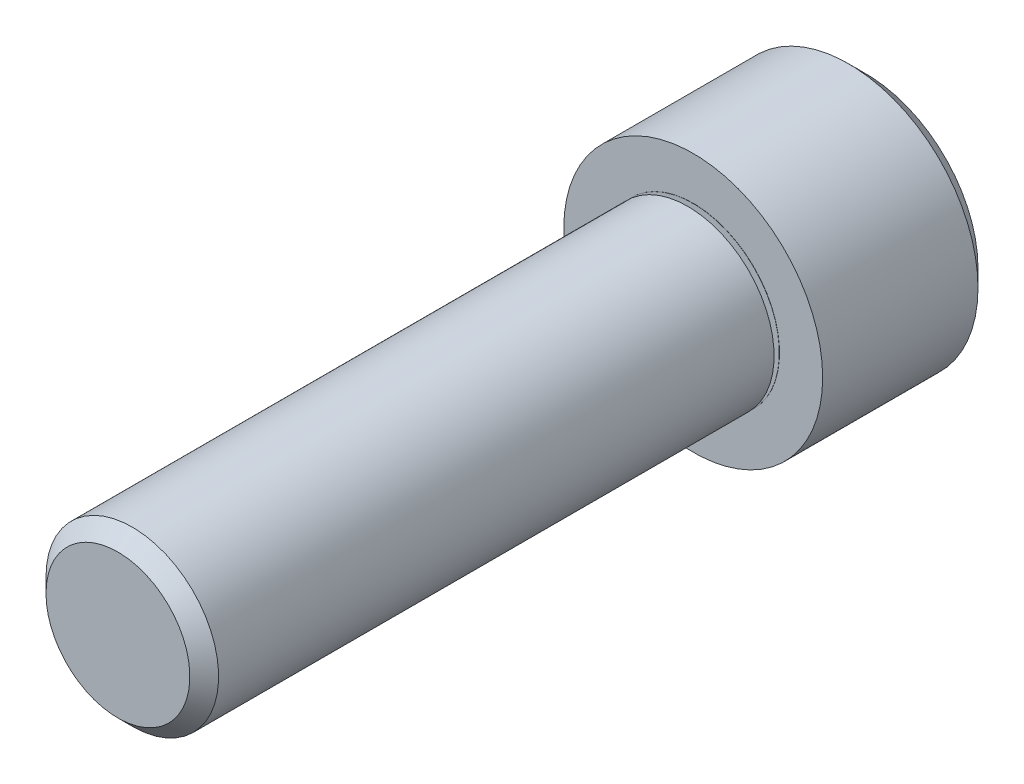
ISO-10303-21;
HEADER;
FILE_DESCRIPTION(('STEP AP214'),'2;1');
FILE_NAME('part.step','',(''),(''),'','','');
FILE_SCHEMA(('AUTOMOTIVE_DESIGN { 1 0 10303 214 1 1 1 1 }'));
ENDSEC;
DATA;
#1=APPLICATION_CONTEXT('core data for automotive mechanical design processes');
#2=APPLICATION_PROTOCOL_DEFINITION('international standard','automotive_design',2000,#1);
#3=PRODUCT_CONTEXT('',#1,'mechanical');
#4=PRODUCT('Part','Part','',(#3));
#5=PRODUCT_RELATED_PRODUCT_CATEGORY('part','',(#4));
#6=PRODUCT_DEFINITION_FORMATION('','',#4);
#7=PRODUCT_DEFINITION_CONTEXT('part definition',#1,'design');
#8=PRODUCT_DEFINITION('design','',#6,#7);
#9=PRODUCT_DEFINITION_SHAPE('','',#8);
#10=(LENGTH_UNIT() NAMED_UNIT(*) SI_UNIT(.MILLI.,.METRE.));
#11=(NAMED_UNIT(*) PLANE_ANGLE_UNIT() SI_UNIT($,.RADIAN.));
#12=(NAMED_UNIT(*) SI_UNIT($,.STERADIAN.) SOLID_ANGLE_UNIT());
#13=UNCERTAINTY_MEASURE_WITH_UNIT(LENGTH_MEASURE(1.E-05),#10,'distance_accuracy_value','');
#14=(GEOMETRIC_REPRESENTATION_CONTEXT(3) GLOBAL_UNCERTAINTY_ASSIGNED_CONTEXT((#13)) GLOBAL_UNIT_ASSIGNED_CONTEXT((#10,
#11,#12)) REPRESENTATION_CONTEXT('',''));
#15=CARTESIAN_POINT('',(0.,0.,0.));
#16=DIRECTION('',(0.,0.,1.));
#17=DIRECTION('',(1.,0.,0.));
#18=AXIS2_PLACEMENT_3D('',#15,#16,#17);
#19=CARTESIAN_POINT('',(0.,0.,-9.525));
#20=DIRECTION('',(0.,0.,1.));
#21=DIRECTION('',(1.,0.,0.));
#22=AXIS2_PLACEMENT_3D('',#19,#20,#21);
#23=PLANE('',#22);
#24=DIRECTION('',(-0.5,-0.866025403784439,0.));
#25=VECTOR('',#24,1.);
#26=CARTESIAN_POINT('',(4.57538541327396,0.,-9.525));
#27=LINE('',#26,#25);
#28=CARTESIAN_POINT('',(4.57538541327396,0.,-9.525));
#29=VERTEX_POINT('',#28);
#30=CARTESIAN_POINT('',(2.28769270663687,-3.96240000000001,-9.525));
#31=VERTEX_POINT('',#30);
#32=EDGE_CURVE('E145',#29,#31,#27,.T.);
#33=ORIENTED_EDGE('',*,*,#32,.F.);
#34=DIRECTION('',(0.499999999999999,-0.866025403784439,0.));
#35=VECTOR('',#34,1.);
#36=CARTESIAN_POINT('',(2.28769270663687,3.96240000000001,-9.525));
#37=LINE('',#36,#35);
#38=CARTESIAN_POINT('',(2.28769270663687,3.96240000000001,-9.525));
#39=VERTEX_POINT('',#38);
#40=EDGE_CURVE('E64',#39,#29,#37,.T.);
#41=ORIENTED_EDGE('',*,*,#40,.F.);
#42=DIRECTION('',(1.,0.,0.));
#43=VECTOR('',#42,1.);
#44=CARTESIAN_POINT('',(-2.28769270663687,3.96240000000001,-9.525));
#45=LINE('',#44,#43);
#46=CARTESIAN_POINT('',(-2.28769270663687,3.96240000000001,-9.525));
#47=VERTEX_POINT('',#46);
#48=EDGE_CURVE('E158',#47,#39,#45,.T.);
#49=ORIENTED_EDGE('',*,*,#48,.F.);
#50=DIRECTION('',(0.5,0.866025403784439,0.));
#51=VECTOR('',#50,1.);
#52=CARTESIAN_POINT('',(-4.57538541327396,0.,-9.525));
#53=LINE('',#52,#51);
#54=CARTESIAN_POINT('',(-4.57538541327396,0.,-9.525));
#55=VERTEX_POINT('',#54);
#56=EDGE_CURVE('E155',#55,#47,#53,.T.);
#57=ORIENTED_EDGE('',*,*,#56,.F.);
#58=DIRECTION('',(-0.5,0.866025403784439,0.));
#59=VECTOR('',#58,1.);
#60=CARTESIAN_POINT('',(-2.28769270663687,-3.96240000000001,-9.525));
#61=LINE('',#60,#59);
#62=CARTESIAN_POINT('',(-2.28769270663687,-3.96240000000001,-9.525));
#63=VERTEX_POINT('',#62);
#64=EDGE_CURVE('E112',#63,#55,#61,.T.);
#65=ORIENTED_EDGE('',*,*,#64,.F.);
#66=DIRECTION('',(-1.,0.,0.));
#67=VECTOR('',#66,1.);
#68=CARTESIAN_POINT('',(2.28769270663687,-3.96240000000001,-9.525));
#69=LINE('',#68,#67);
#70=EDGE_CURVE('E149',#31,#63,#69,.T.);
#71=ORIENTED_EDGE('',*,*,#70,.F.);
#72=EDGE_LOOP('',(#33,#41,#49,#57,#65,#71));
#73=FACE_BOUND('',#72,.T.);
#74=CARTESIAN_POINT('',(0.,0.,-9.525));
#75=DIRECTION('',(0.,0.,-1.));
#76=DIRECTION('',(-1.,0.,0.));
#77=AXIS2_PLACEMENT_3D('',#74,#75,#76);
#78=CIRCLE('',#77,6.19125000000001);
#79=CARTESIAN_POINT('',(-6.19125000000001,0.,-9.525));
#80=VERTEX_POINT('',#79);
#81=EDGE_CURVE('E164',#80,#80,#78,.T.);
#82=ORIENTED_EDGE('',*,*,#81,.T.);
#83=EDGE_LOOP('',(#82));
#84=FACE_BOUND('',#83,.T.);
#85=ADVANCED_FACE('F49',(#73,#84),#23,.F.);
#86=CARTESIAN_POINT('',(-3.96875000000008,0.,31.75));
#87=DIRECTION('',(0.,0.,-1.));
#88=DIRECTION('',(-1.,0.,0.));
#89=AXIS2_PLACEMENT_3D('',#86,#87,#88);
#90=PLANE('',#89);
#91=CARTESIAN_POINT('',(0.,0.,31.75));
#92=DIRECTION('',(0.,0.,-1.));
#93=DIRECTION('',(-1.,0.,0.));
#94=AXIS2_PLACEMENT_3D('',#91,#92,#93);
#95=CIRCLE('',#94,3.96875000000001);
#96=CARTESIAN_POINT('',(-3.96875000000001,0.,31.75));
#97=VERTEX_POINT('',#96);
#98=EDGE_CURVE('E11',#97,#97,#95,.T.);
#99=ORIENTED_EDGE('',*,*,#98,.F.);
#100=EDGE_LOOP('',(#99));
#101=FACE_BOUND('',#100,.T.);
#102=ADVANCED_FACE('F214',(#101),#90,.F.);
#103=CARTESIAN_POINT('',(0.,0.,31.75));
#104=DIRECTION('',(0.,0.,-1.));
#105=DIRECTION('',(-1.,0.,0.));
#106=AXIS2_PLACEMENT_3D('',#103,#104,#105);
#107=CONICAL_SURFACE('',#106,3.96875000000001,0.785398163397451);
#108=CARTESIAN_POINT('',(0.,0.,30.95625));
#109=DIRECTION('',(0.,0.,-1.));
#110=DIRECTION('',(-1.,0.,0.));
#111=AXIS2_PLACEMENT_3D('',#108,#109,#110);
#112=CIRCLE('',#111,4.76250000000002);
#113=CARTESIAN_POINT('',(-4.76250000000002,0.,30.95625));
#114=VERTEX_POINT('',#113);
#115=EDGE_CURVE('E57',#114,#114,#112,.T.);
#116=ORIENTED_EDGE('',*,*,#115,.F.);
#117=EDGE_LOOP('',(#116));
#118=FACE_BOUND('',#117,.T.);
#119=ORIENTED_EDGE('',*,*,#98,.T.);
#120=EDGE_LOOP('',(#119));
#121=FACE_BOUND('',#120,.T.);
#122=ADVANCED_FACE('F211',(#118,#121),#107,.T.);
#123=CARTESIAN_POINT('',(0.,0.,-10.585154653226));
#124=DIRECTION('',(0.,0.,-1.));
#125=DIRECTION('',(-1.,0.,0.));
#126=AXIS2_PLACEMENT_3D('',#123,#124,#125);
#127=CYLINDRICAL_SURFACE('',#126,4.76250000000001);
#128=CARTESIAN_POINT('',(0.,0.,0.29890137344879));
#129=DIRECTION('',(0.,0.,-1.));
#130=DIRECTION('',(-1.,0.,0.));
#131=AXIS2_PLACEMENT_3D('',#128,#129,#130);
#132=CIRCLE('',#131,4.7625);
#133=CARTESIAN_POINT('',(-4.7625,0.,0.29890137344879));
#134=VERTEX_POINT('',#133);
#135=EDGE_CURVE('E201',#134,#134,#132,.T.);
#136=ORIENTED_EDGE('',*,*,#135,.F.);
#137=EDGE_LOOP('',(#136));
#138=FACE_BOUND('',#137,.T.);
#139=ORIENTED_EDGE('',*,*,#115,.T.);
#140=EDGE_LOOP('',(#139));
#141=FACE_BOUND('',#140,.T.);
#142=ADVANCED_FACE('F209',(#138,#141),#127,.T.);
#143=CARTESIAN_POINT('',(0.,0.,0.29890137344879));
#144=DIRECTION('',(0.,0.,1.));
#145=DIRECTION('',(1.,0.,0.));
#146=AXIS2_PLACEMENT_3D('',#143,#144,#145);
#147=CONICAL_SURFACE('',#146,4.7625,1.22173047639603);
#148=CARTESIAN_POINT('',(0.,0.,0.0487938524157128));
#149=DIRECTION('',(0.,0.,-1.));
#150=DIRECTION('',(-1.,0.,0.));
#151=AXIS2_PLACEMENT_3D('',#148,#149,#150);
#152=CIRCLE('',#151,4.07533523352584);
#153=CARTESIAN_POINT('',(-4.07533523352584,0.,0.0487938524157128));
#154=VERTEX_POINT('',#153);
#155=EDGE_CURVE('E197',#154,#154,#152,.T.);
#156=ORIENTED_EDGE('',*,*,#155,.F.);
#157=EDGE_LOOP('',(#156));
#158=FACE_BOUND('',#157,.T.);
#159=ORIENTED_EDGE('',*,*,#135,.T.);
#160=EDGE_LOOP('',(#159));
#161=FACE_BOUND('',#160,.T.);
#162=ADVANCED_FACE('F226',(#158,#161),#147,.T.);
#163=CARTESIAN_POINT('',(0.,0.,0.0300000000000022));
#164=DIRECTION('',(0.,0.,-1.));
#165=DIRECTION('',(-1.,0.,0.));
#166=AXIS2_PLACEMENT_3D('',#163,#164,#165);
#167=TOROIDAL_SURFACE('',#166,4.08217563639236,0.0199999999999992);
#168=CARTESIAN_POINT('',(0.,0.,0.0100000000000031));
#169=DIRECTION('',(0.,0.,-1.));
#170=DIRECTION('',(-1.,0.,0.));
#171=AXIS2_PLACEMENT_3D('',#168,#169,#170);
#172=CIRCLE('',#171,4.08217563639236);
#173=CARTESIAN_POINT('',(-4.08217563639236,0.,0.0100000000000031));
#174=VERTEX_POINT('',#173);
#175=EDGE_CURVE('E193',#174,#174,#172,.T.);
#176=ORIENTED_EDGE('',*,*,#175,.F.);
#177=EDGE_LOOP('',(#176));
#178=FACE_BOUND('',#177,.T.);
#179=ORIENTED_EDGE('',*,*,#155,.T.);
#180=EDGE_LOOP('',(#179));
#181=FACE_BOUND('',#180,.T.);
#182=ADVANCED_FACE('F230',(#178,#181),#167,.F.);
#183=CARTESIAN_POINT('',(-4.7625,0.,0.00999999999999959));
#184=DIRECTION('',(0.,0.,-1.));
#185=DIRECTION('',(-1.,0.,0.));
#186=AXIS2_PLACEMENT_3D('',#183,#184,#185);
#187=PLANE('',#186);
#188=CARTESIAN_POINT('',(0.,0.,0.00999999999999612));
#189=DIRECTION('',(0.,0.,-1.));
#190=DIRECTION('',(-1.,0.,0.));
#191=AXIS2_PLACEMENT_3D('',#188,#189,#190);
#192=CIRCLE('',#191,4.7625);
#193=CARTESIAN_POINT('',(-4.7625,0.,0.00999999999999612));
#194=VERTEX_POINT('',#193);
#195=EDGE_CURVE('E189',#194,#194,#192,.T.);
#196=ORIENTED_EDGE('',*,*,#195,.F.);
#197=EDGE_LOOP('',(#196));
#198=FACE_BOUND('',#197,.T.);
#199=ORIENTED_EDGE('',*,*,#175,.T.);
#200=EDGE_LOOP('',(#199));
#201=FACE_BOUND('',#200,.T.);
#202=ADVANCED_FACE('F234',(#198,#201),#187,.F.);
#203=CARTESIAN_POINT('',(0.,0.,-10.585154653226));
#204=DIRECTION('',(0.,0.,-1.));
#205=DIRECTION('',(-1.,0.,0.));
#206=AXIS2_PLACEMENT_3D('',#203,#204,#205);
#207=CYLINDRICAL_SURFACE('',#206,4.7625);
#208=CARTESIAN_POINT('',(0.,0.,0.));
#209=DIRECTION('',(0.,0.,-1.));
#210=DIRECTION('',(-1.,0.,0.));
#211=AXIS2_PLACEMENT_3D('',#208,#209,#210);
#212=CIRCLE('',#211,4.7625);
#213=CARTESIAN_POINT('',(-4.7625,0.,0.));
#214=VERTEX_POINT('',#213);
#215=EDGE_CURVE('E185',#214,#214,#212,.T.);
#216=ORIENTED_EDGE('',*,*,#215,.F.);
#217=EDGE_LOOP('',(#216));
#218=FACE_BOUND('',#217,.T.);
#219=ORIENTED_EDGE('',*,*,#195,.T.);
#220=EDGE_LOOP('',(#219));
#221=FACE_BOUND('',#220,.T.);
#222=ADVANCED_FACE('F238',(#218,#221),#207,.T.);
#223=CARTESIAN_POINT('',(-7.14375,0.,0.));
#224=DIRECTION('',(0.,0.,-1.));
#225=DIRECTION('',(-1.,0.,0.));
#226=AXIS2_PLACEMENT_3D('',#223,#224,#225);
#227=PLANE('',#226);
#228=CARTESIAN_POINT('',(0.,0.,0.));
#229=DIRECTION('',(0.,0.,-1.));
#230=DIRECTION('',(-1.,0.,0.));
#231=AXIS2_PLACEMENT_3D('',#228,#229,#230);
#232=CIRCLE('',#231,7.14375000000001);
#233=CARTESIAN_POINT('',(-7.14375000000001,0.,0.));
#234=VERTEX_POINT('',#233);
#235=EDGE_CURVE('E181',#234,#234,#232,.T.);
#236=ORIENTED_EDGE('',*,*,#235,.F.);
#237=EDGE_LOOP('',(#236));
#238=FACE_BOUND('',#237,.T.);
#239=ORIENTED_EDGE('',*,*,#215,.T.);
#240=EDGE_LOOP('',(#239));
#241=FACE_BOUND('',#240,.T.);
#242=ADVANCED_FACE('F242',(#238,#241),#227,.F.);
#243=CARTESIAN_POINT('',(0.,0.,-10.585154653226));
#244=DIRECTION('',(0.,0.,-1.));
#245=DIRECTION('',(-1.,0.,0.));
#246=AXIS2_PLACEMENT_3D('',#243,#244,#245);
#247=CYLINDRICAL_SURFACE('',#246,7.14375);
#248=CARTESIAN_POINT('',(0.,0.,-8.57249999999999));
#249=DIRECTION('',(0.,0.,-1.));
#250=DIRECTION('',(-1.,0.,0.));
#251=AXIS2_PLACEMENT_3D('',#248,#249,#250);
#252=CIRCLE('',#251,7.14375);
#253=CARTESIAN_POINT('',(-7.14375,0.,-8.57249999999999));
#254=VERTEX_POINT('',#253);
#255=EDGE_CURVE('E177',#254,#254,#252,.T.);
#256=ORIENTED_EDGE('',*,*,#255,.F.);
#257=EDGE_LOOP('',(#256));
#258=FACE_BOUND('',#257,.T.);
#259=ORIENTED_EDGE('',*,*,#235,.T.);
#260=EDGE_LOOP('',(#259));
#261=FACE_BOUND('',#260,.T.);
#262=ADVANCED_FACE('F246',(#258,#261),#247,.T.);
#263=CARTESIAN_POINT('',(0.,0.,-8.57249999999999));
#264=DIRECTION('',(0.,0.,1.));
#265=DIRECTION('',(1.,0.,0.));
#266=AXIS2_PLACEMENT_3D('',#263,#264,#265);
#267=CONICAL_SURFACE('',#266,7.14375,0.785398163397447);
#268=ORIENTED_EDGE('',*,*,#81,.F.);
#269=EDGE_LOOP('',(#268));
#270=FACE_BOUND('',#269,.T.);
#271=ORIENTED_EDGE('',*,*,#255,.T.);
#272=EDGE_LOOP('',(#271));
#273=FACE_BOUND('',#272,.T.);
#274=ADVANCED_FACE('F250',(#270,#273),#267,.T.);
#275=CARTESIAN_POINT('',(2.28769270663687,3.96240000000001,-4.7625));
#276=DIRECTION('',(0.866025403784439,0.499999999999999,0.));
#277=DIRECTION('',(-0.499999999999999,0.866025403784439,0.));
#278=AXIS2_PLACEMENT_3D('',#275,#276,#277);
#279=PLANE('',#278);
#280=ORIENTED_EDGE('',*,*,#40,.T.);
#281=DIRECTION('',(0.,0.,-1.));
#282=VECTOR('',#281,1.);
#283=CARTESIAN_POINT('',(4.57538541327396,0.,-4.7625));
#284=LINE('',#283,#282);
#285=CARTESIAN_POINT('',(4.57538541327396,0.,-4.7625));
#286=VERTEX_POINT('',#285);
#287=EDGE_CURVE('E94',#286,#29,#284,.T.);
#288=ORIENTED_EDGE('',*,*,#287,.F.);
#289=DIRECTION('',(0.499999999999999,-0.866025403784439,0.));
#290=VECTOR('',#289,1.);
#291=CARTESIAN_POINT('',(2.28769270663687,3.96240000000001,-4.7625));
#292=LINE('',#291,#290);
#293=CARTESIAN_POINT('',(2.28769270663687,3.96240000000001,-4.7625));
#294=VERTEX_POINT('',#293);
#295=EDGE_CURVE('E161',#294,#286,#292,.T.);
#296=ORIENTED_EDGE('',*,*,#295,.F.);
#297=DIRECTION('',(0.,0.,-1.));
#298=VECTOR('',#297,1.);
#299=CARTESIAN_POINT('',(2.28769270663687,3.96240000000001,-4.7625));
#300=LINE('',#299,#298);
#301=EDGE_CURVE('E72',#294,#39,#300,.T.);
#302=ORIENTED_EDGE('',*,*,#301,.T.);
#303=EDGE_LOOP('',(#280,#288,#296,#302));
#304=FACE_BOUND('',#303,.T.);
#305=ADVANCED_FACE('F254',(#304),#279,.F.);
#306=CARTESIAN_POINT('',(-2.28769270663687,3.96240000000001,-4.7625));
#307=DIRECTION('',(0.,1.,0.));
#308=DIRECTION('',(-1.,0.,0.));
#309=AXIS2_PLACEMENT_3D('',#306,#307,#308);
#310=PLANE('',#309);
#311=ORIENTED_EDGE('',*,*,#48,.T.);
#312=ORIENTED_EDGE('',*,*,#301,.F.);
#313=DIRECTION('',(1.,0.,0.));
#314=VECTOR('',#313,1.);
#315=CARTESIAN_POINT('',(-2.28769270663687,3.96240000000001,-4.7625));
#316=LINE('',#315,#314);
#317=CARTESIAN_POINT('',(-2.28769270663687,3.96240000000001,-4.7625));
#318=VERTEX_POINT('',#317);
#319=EDGE_CURVE('E126',#318,#294,#316,.T.);
#320=ORIENTED_EDGE('',*,*,#319,.F.);
#321=DIRECTION('',(0.,0.,-1.));
#322=VECTOR('',#321,1.);
#323=CARTESIAN_POINT('',(-2.28769270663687,3.96240000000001,-4.7625));
#324=LINE('',#323,#322);
#325=EDGE_CURVE('E117',#318,#47,#324,.T.);
#326=ORIENTED_EDGE('',*,*,#325,.T.);
#327=EDGE_LOOP('',(#311,#312,#320,#326));
#328=FACE_BOUND('',#327,.T.);
#329=ADVANCED_FACE('F258',(#328),#310,.F.);
#330=CARTESIAN_POINT('',(-4.57538541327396,0.,-4.7625));
#331=DIRECTION('',(-0.866025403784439,0.5,0.));
#332=DIRECTION('',(-0.5,-0.866025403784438,0.));
#333=AXIS2_PLACEMENT_3D('',#330,#331,#332);
#334=PLANE('',#333);
#335=ORIENTED_EDGE('',*,*,#56,.T.);
#336=ORIENTED_EDGE('',*,*,#325,.F.);
#337=DIRECTION('',(0.5,0.866025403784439,0.));
#338=VECTOR('',#337,1.);
#339=CARTESIAN_POINT('',(-4.57538541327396,0.,-4.7625));
#340=LINE('',#339,#338);
#341=CARTESIAN_POINT('',(-4.57538541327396,0.,-4.7625));
#342=VERTEX_POINT('',#341);
#343=EDGE_CURVE('E121',#342,#318,#340,.T.);
#344=ORIENTED_EDGE('',*,*,#343,.F.);
#345=DIRECTION('',(0.,0.,-1.));
#346=VECTOR('',#345,1.);
#347=CARTESIAN_POINT('',(-4.57538541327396,0.,-4.7625));
#348=LINE('',#347,#346);
#349=EDGE_CURVE('E105',#342,#55,#348,.T.);
#350=ORIENTED_EDGE('',*,*,#349,.T.);
#351=EDGE_LOOP('',(#335,#336,#344,#350));
#352=FACE_BOUND('',#351,.T.);
#353=ADVANCED_FACE('F122',(#352),#334,.F.);
#354=CARTESIAN_POINT('',(-2.28769270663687,-3.96240000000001,-4.7625));
#355=DIRECTION('',(-0.866025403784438,-0.5,0.));
#356=DIRECTION('',(0.5,-0.866025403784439,0.));
#357=AXIS2_PLACEMENT_3D('',#354,#355,#356);
#358=PLANE('',#357);
#359=ORIENTED_EDGE('',*,*,#64,.T.);
#360=ORIENTED_EDGE('',*,*,#349,.F.);
#361=DIRECTION('',(-0.5,0.866025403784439,0.));
#362=VECTOR('',#361,1.);
#363=CARTESIAN_POINT('',(-2.28769270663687,-3.96240000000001,-4.7625));
#364=LINE('',#363,#362);
#365=CARTESIAN_POINT('',(-2.28769270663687,-3.96240000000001,-4.7625));
#366=VERTEX_POINT('',#365);
#367=EDGE_CURVE('E109',#366,#342,#364,.T.);
#368=ORIENTED_EDGE('',*,*,#367,.F.);
#369=DIRECTION('',(0.,0.,-1.));
#370=VECTOR('',#369,1.);
#371=CARTESIAN_POINT('',(-2.28769270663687,-3.96240000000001,-4.7625));
#372=LINE('',#371,#370);
#373=EDGE_CURVE('E118',#366,#63,#372,.T.);
#374=ORIENTED_EDGE('',*,*,#373,.T.);
#375=EDGE_LOOP('',(#359,#360,#368,#374));
#376=FACE_BOUND('',#375,.T.);
#377=ADVANCED_FACE('F107',(#376),#358,.F.);
#378=CARTESIAN_POINT('',(2.28769270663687,-3.96240000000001,-4.7625));
#379=DIRECTION('',(0.,-1.,0.));
#380=DIRECTION('',(0.,0.,-1.));
#381=AXIS2_PLACEMENT_3D('',#378,#379,#380);
#382=PLANE('',#381);
#383=ORIENTED_EDGE('',*,*,#70,.T.);
#384=ORIENTED_EDGE('',*,*,#373,.F.);
#385=DIRECTION('',(-1.,0.,0.));
#386=VECTOR('',#385,1.);
#387=CARTESIAN_POINT('',(2.28769270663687,-3.96240000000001,-4.7625));
#388=LINE('',#387,#386);
#389=CARTESIAN_POINT('',(2.28769270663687,-3.96240000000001,-4.7625));
#390=VERTEX_POINT('',#389);
#391=EDGE_CURVE('E132',#390,#366,#388,.T.);
#392=ORIENTED_EDGE('',*,*,#391,.F.);
#393=DIRECTION('',(0.,0.,-1.));
#394=VECTOR('',#393,1.);
#395=CARTESIAN_POINT('',(2.28769270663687,-3.96240000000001,-4.7625));
#396=LINE('',#395,#394);
#397=EDGE_CURVE('E169',#390,#31,#396,.T.);
#398=ORIENTED_EDGE('',*,*,#397,.T.);
#399=EDGE_LOOP('',(#383,#384,#392,#398));
#400=FACE_BOUND('',#399,.T.);
#401=ADVANCED_FACE('F262',(#400),#382,.F.);
#402=CARTESIAN_POINT('',(4.57538541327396,0.,-4.7625));
#403=DIRECTION('',(0.866025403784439,-0.5,0.));
#404=DIRECTION('',(0.5,0.866025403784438,0.));
#405=AXIS2_PLACEMENT_3D('',#402,#403,#404);
#406=PLANE('',#405);
#407=ORIENTED_EDGE('',*,*,#32,.T.);
#408=ORIENTED_EDGE('',*,*,#397,.F.);
#409=DIRECTION('',(-0.5,-0.866025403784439,0.));
#410=VECTOR('',#409,1.);
#411=CARTESIAN_POINT('',(4.57538541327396,0.,-4.7625));
#412=LINE('',#411,#410);
#413=EDGE_CURVE('E137',#286,#390,#412,.T.);
#414=ORIENTED_EDGE('',*,*,#413,.F.);
#415=ORIENTED_EDGE('',*,*,#287,.T.);
#416=EDGE_LOOP('',(#407,#408,#414,#415));
#417=FACE_BOUND('',#416,.T.);
#418=ADVANCED_FACE('F259',(#417),#406,.F.);
#419=CARTESIAN_POINT('',(2.28769270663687,3.96240000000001,-4.7625));
#420=DIRECTION('',(0.,0.,1.));
#421=DIRECTION('',(1.,0.,0.));
#422=AXIS2_PLACEMENT_3D('',#419,#420,#421);
#423=PLANE('',#422);
#424=ORIENTED_EDGE('',*,*,#295,.T.);
#425=ORIENTED_EDGE('',*,*,#413,.T.);
#426=ORIENTED_EDGE('',*,*,#391,.T.);
#427=ORIENTED_EDGE('',*,*,#367,.T.);
#428=ORIENTED_EDGE('',*,*,#343,.T.);
#429=ORIENTED_EDGE('',*,*,#319,.T.);
#430=EDGE_LOOP('',(#424,#425,#426,#427,#428,#429));
#431=FACE_BOUND('',#430,.T.);
#432=ADVANCED_FACE('F129',(#431),#423,.F.);
#433=CLOSED_SHELL('',(#85,#102,#122,#142,#162,#182,#202,#222,#242,#262,#274,#305,#329,#353,#377,
#401,#418,#432));
#434=MANIFOLD_SOLID_BREP('B2',#433);
#435=ADVANCED_BREP_SHAPE_REPRESENTATION('',(#18,#434),#14);
#436=SHAPE_DEFINITION_REPRESENTATION(#9,#435);
ENDSEC;
END-ISO-10303-21;
